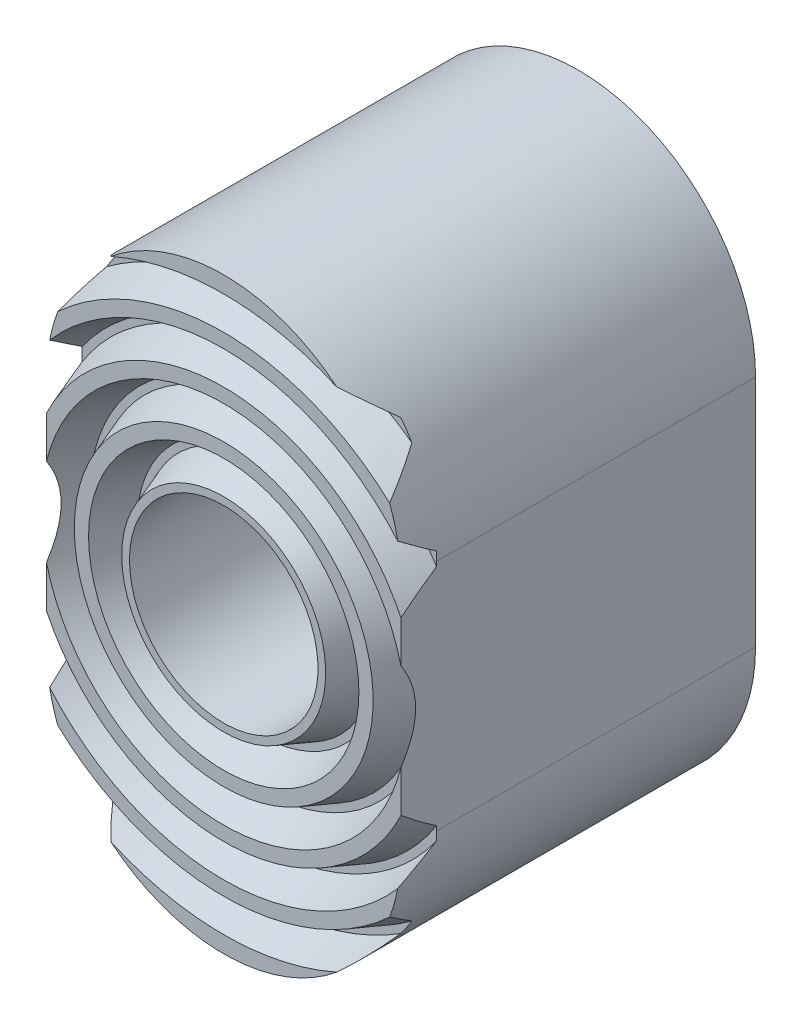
ISO-10303-21;
HEADER;
FILE_DESCRIPTION(('STEP AP214'),'2;1');
FILE_NAME('part.step','',(''),(''),'','','');
FILE_SCHEMA(('AUTOMOTIVE_DESIGN { 1 0 10303 214 1 1 1 1 }'));
ENDSEC;
DATA;
#1=APPLICATION_CONTEXT('core data for automotive mechanical design processes');
#2=APPLICATION_PROTOCOL_DEFINITION('international standard','automotive_design',2000,#1);
#3=PRODUCT_CONTEXT('',#1,'mechanical');
#4=PRODUCT('Part','Part','',(#3));
#5=PRODUCT_RELATED_PRODUCT_CATEGORY('part','',(#4));
#6=PRODUCT_DEFINITION_FORMATION('','',#4);
#7=PRODUCT_DEFINITION_CONTEXT('part definition',#1,'design');
#8=PRODUCT_DEFINITION('design','',#6,#7);
#9=PRODUCT_DEFINITION_SHAPE('','',#8);
#10=(LENGTH_UNIT() NAMED_UNIT(*) SI_UNIT(.MILLI.,.METRE.));
#11=(NAMED_UNIT(*) PLANE_ANGLE_UNIT() SI_UNIT($,.RADIAN.));
#12=(NAMED_UNIT(*) SI_UNIT($,.STERADIAN.) SOLID_ANGLE_UNIT());
#13=UNCERTAINTY_MEASURE_WITH_UNIT(LENGTH_MEASURE(1.E-05),#10,'distance_accuracy_value','');
#14=(GEOMETRIC_REPRESENTATION_CONTEXT(3) GLOBAL_UNCERTAINTY_ASSIGNED_CONTEXT((#13)) GLOBAL_UNIT_ASSIGNED_CONTEXT((#10,
#11,#12)) REPRESENTATION_CONTEXT('',''));
#15=CARTESIAN_POINT('',(0.,0.,0.));
#16=DIRECTION('',(0.,0.,1.));
#17=DIRECTION('',(1.,0.,0.));
#18=AXIS2_PLACEMENT_3D('',#15,#16,#17);
#19=CARTESIAN_POINT('',(0.,-2.5019,0.));
#20=DIRECTION('',(0.,0.,1.));
#21=DIRECTION('',(1.,0.,0.));
#22=AXIS2_PLACEMENT_3D('',#19,#20,#21);
#23=PLANE('',#22);
#24=CARTESIAN_POINT('',(0.,-2.5019,0.));
#25=DIRECTION('',(0.,0.,1.));
#26=DIRECTION('',(1.,0.,0.));
#27=AXIS2_PLACEMENT_3D('',#24,#25,#26);
#28=CIRCLE('',#27,3.7973);
#29=CARTESIAN_POINT('',(-3.7973,-2.5019,0.));
#30=VERTEX_POINT('',#29);
#31=CARTESIAN_POINT('',(3.7973,-2.5019,0.));
#32=VERTEX_POINT('',#31);
#33=EDGE_CURVE('E225',#30,#32,#28,.T.);
#34=ORIENTED_EDGE('',*,*,#33,.F.);
#35=DIRECTION('',(0.,-1.,0.));
#36=VECTOR('',#35,1.);
#37=CARTESIAN_POINT('',(-3.7973,-2.5019,0.));
#38=LINE('',#37,#36);
#39=CARTESIAN_POINT('',(-3.7973,2.5019,0.));
#40=VERTEX_POINT('',#39);
#41=EDGE_CURVE('E235',#40,#30,#38,.T.);
#42=ORIENTED_EDGE('',*,*,#41,.F.);
#43=CARTESIAN_POINT('',(0.,2.5019,0.));
#44=DIRECTION('',(0.,0.,1.));
#45=DIRECTION('',(1.,0.,0.));
#46=AXIS2_PLACEMENT_3D('',#43,#44,#45);
#47=CIRCLE('',#46,3.7973);
#48=CARTESIAN_POINT('',(3.7973,2.5019,0.));
#49=VERTEX_POINT('',#48);
#50=EDGE_CURVE('E232',#49,#40,#47,.T.);
#51=ORIENTED_EDGE('',*,*,#50,.F.);
#52=DIRECTION('',(0.,1.,0.));
#53=VECTOR('',#52,1.);
#54=CARTESIAN_POINT('',(3.7973,-2.5019,0.));
#55=LINE('',#54,#53);
#56=EDGE_CURVE('E228',#32,#49,#55,.T.);
#57=ORIENTED_EDGE('',*,*,#56,.F.);
#58=EDGE_LOOP('',(#34,#42,#51,#57));
#59=FACE_BOUND('',#58,.T.);
#60=CARTESIAN_POINT('',(0.,0.,0.));
#61=DIRECTION('',(0.,0.,-1.));
#62=DIRECTION('',(-1.,0.,0.));
#63=AXIS2_PLACEMENT_3D('',#60,#61,#62);
#64=CIRCLE('',#63,2.0193);
#65=CARTESIAN_POINT('',(-2.0193,0.,0.));
#66=VERTEX_POINT('',#65);
#67=EDGE_CURVE('E366',#66,#66,#64,.T.);
#68=ORIENTED_EDGE('',*,*,#67,.F.);
#69=EDGE_LOOP('',(#68));
#70=FACE_BOUND('',#69,.T.);
#71=ADVANCED_FACE('F41',(#59,#70),#23,.F.);
#72=CARTESIAN_POINT('',(0.,-2.5019,7.5946));
#73=DIRECTION('',(0.,0.,1.));
#74=DIRECTION('',(1.,0.,0.));
#75=AXIS2_PLACEMENT_3D('',#72,#73,#74);
#76=PLANE('',#75);
#77=CARTESIAN_POINT('',(0.,0.,7.5946));
#78=DIRECTION('',(0.,0.,-1.));
#79=DIRECTION('',(-1.,0.,0.));
#80=AXIS2_PLACEMENT_3D('',#77,#78,#79);
#81=CIRCLE('',#80,3.2004);
#82=CARTESIAN_POINT('',(-3.2004,0.,7.5946));
#83=VERTEX_POINT('',#82);
#84=EDGE_CURVE('E198',#83,#83,#81,.T.);
#85=ORIENTED_EDGE('',*,*,#84,.F.);
#86=EDGE_LOOP('',(#85));
#87=FACE_BOUND('',#86,.T.);
#88=CARTESIAN_POINT('',(0.,0.,7.5946));
#89=DIRECTION('',(0.,0.,-1.));
#90=DIRECTION('',(-1.,0.,0.));
#91=AXIS2_PLACEMENT_3D('',#88,#89,#90);
#92=CIRCLE('',#91,2.8956);
#93=CARTESIAN_POINT('',(-2.8956,0.,7.5946));
#94=VERTEX_POINT('',#93);
#95=EDGE_CURVE('E528',#94,#94,#92,.T.);
#96=ORIENTED_EDGE('',*,*,#95,.T.);
#97=EDGE_LOOP('',(#96));
#98=FACE_BOUND('',#97,.T.);
#99=ADVANCED_FACE('F348',(#87,#98),#76,.T.);
#100=CARTESIAN_POINT('',(0.,2.61825468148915,6.8326));
#101=DIRECTION('',(0.,0.,-1.));
#102=DIRECTION('',(-1.,0.,0.));
#103=AXIS2_PLACEMENT_3D('',#100,#101,#102);
#104=PLANE('',#103);
#105=CARTESIAN_POINT('',(0.,0.,6.8326));
#106=DIRECTION('',(0.,0.,-1.));
#107=DIRECTION('',(-1.,0.,0.));
#108=AXIS2_PLACEMENT_3D('',#105,#106,#107);
#109=CIRCLE('',#108,2.61825468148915);
#110=CARTESIAN_POINT('',(-2.61825468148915,0.,6.8326));
#111=VERTEX_POINT('',#110);
#112=EDGE_CURVE('E531',#111,#111,#109,.T.);
#113=ORIENTED_EDGE('',*,*,#112,.F.);
#114=EDGE_LOOP('',(#113));
#115=FACE_BOUND('',#114,.T.);
#116=CARTESIAN_POINT('',(0.,0.,6.8326));
#117=DIRECTION('',(0.,0.,-1.));
#118=DIRECTION('',(-1.,0.,0.));
#119=AXIS2_PLACEMENT_3D('',#116,#117,#118);
#120=CIRCLE('',#119,2.46174531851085);
#121=CARTESIAN_POINT('',(-2.46174531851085,0.,6.8326));
#122=VERTEX_POINT('',#121);
#123=EDGE_CURVE('E229',#122,#122,#120,.T.);
#124=ORIENTED_EDGE('',*,*,#123,.T.);
#125=EDGE_LOOP('',(#124));
#126=FACE_BOUND('',#125,.T.);
#127=ADVANCED_FACE('F344',(#115,#126),#104,.F.);
#128=CARTESIAN_POINT('',(0.,0.,7.5946));
#129=DIRECTION('',(0.,0.,-1.));
#130=DIRECTION('',(-1.,0.,0.));
#131=AXIS2_PLACEMENT_3D('',#128,#129,#130);
#132=CONICAL_SURFACE('',#131,2.1844,0.349065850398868);
#133=ORIENTED_EDGE('',*,*,#123,.F.);
#134=EDGE_LOOP('',(#133));
#135=FACE_BOUND('',#134,.T.);
#136=CARTESIAN_POINT('',(0.,0.,7.5946));
#137=DIRECTION('',(0.,0.,-1.));
#138=DIRECTION('',(-1.,0.,0.));
#139=AXIS2_PLACEMENT_3D('',#136,#137,#138);
#140=CIRCLE('',#139,2.1844);
#141=CARTESIAN_POINT('',(-2.1844,0.,7.5946));
#142=VERTEX_POINT('',#141);
#143=EDGE_CURVE('E525',#142,#142,#140,.T.);
#144=ORIENTED_EDGE('',*,*,#143,.T.);
#145=EDGE_LOOP('',(#144));
#146=FACE_BOUND('',#145,.T.);
#147=ADVANCED_FACE('F340',(#135,#146),#132,.T.);
#148=CARTESIAN_POINT('',(0.,0.,6.8326));
#149=DIRECTION('',(0.,0.,1.));
#150=DIRECTION('',(1.,0.,0.));
#151=AXIS2_PLACEMENT_3D('',#148,#149,#150);
#152=CONICAL_SURFACE('',#151,2.61825468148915,0.349065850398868);
#153=ORIENTED_EDGE('',*,*,#95,.F.);
#154=EDGE_LOOP('',(#153));
#155=FACE_BOUND('',#154,.T.);
#156=ORIENTED_EDGE('',*,*,#112,.T.);
#157=EDGE_LOOP('',(#156));
#158=FACE_BOUND('',#157,.T.);
#159=ADVANCED_FACE('F337',(#155,#158),#152,.F.);
#160=CARTESIAN_POINT('',(0.,0.,7.5946));
#161=DIRECTION('',(0.,0.,-1.));
#162=DIRECTION('',(-1.,0.,0.));
#163=AXIS2_PLACEMENT_3D('',#160,#161,#162);
#164=CIRCLE('',#163,2.0193);
#165=CARTESIAN_POINT('',(-2.0193,0.,7.5946));
#166=VERTEX_POINT('',#165);
#167=EDGE_CURVE('E368',#166,#166,#164,.T.);
#168=ORIENTED_EDGE('',*,*,#167,.T.);
#169=EDGE_LOOP('',(#168));
#170=FACE_BOUND('',#169,.T.);
#171=ORIENTED_EDGE('',*,*,#143,.F.);
#172=EDGE_LOOP('',(#171));
#173=FACE_BOUND('',#172,.T.);
#174=ADVANCED_FACE('F324',(#170,#173),#76,.T.);
#175=CARTESIAN_POINT('',(0.,0.,6.8326));
#176=DIRECTION('',(0.,0.,1.));
#177=DIRECTION('',(1.,0.,0.));
#178=AXIS2_PLACEMENT_3D('',#175,#176,#177);
#179=CONICAL_SURFACE('',#178,3.63425468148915,0.349065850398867);
#180=CARTESIAN_POINT('',(0.,0.,6.8326));
#181=DIRECTION('',(0.,0.,-1.));
#182=DIRECTION('',(-1.,0.,0.));
#183=AXIS2_PLACEMENT_3D('',#180,#181,#182);
#184=CIRCLE('',#183,3.63425468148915);
#185=CARTESIAN_POINT('',(-3.63425468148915,0.,6.8326));
#186=VERTEX_POINT('',#185);
#187=EDGE_CURVE('E199',#186,#186,#184,.T.);
#188=ORIENTED_EDGE('',*,*,#187,.T.);
#189=EDGE_LOOP('',(#188));
#190=FACE_BOUND('',#189,.T.);
#191=CARTESIAN_POINT('',(0.,0.,7.5946));
#192=DIRECTION('',(0.,0.,-1.));
#193=DIRECTION('',(-1.,0.,0.));
#194=AXIS2_PLACEMENT_3D('',#191,#192,#193);
#195=CIRCLE('',#194,3.9116);
#196=CARTESIAN_POINT('',(-3.7973,0.938683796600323,7.5946));
#197=VERTEX_POINT('',#196);
#198=CARTESIAN_POINT('',(3.7973,0.938683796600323,7.5946));
#199=VERTEX_POINT('',#198);
#200=EDGE_CURVE('E190',#197,#199,#195,.T.);
#201=ORIENTED_EDGE('',*,*,#200,.F.);
#202=CARTESIAN_POINT('',(-3.7973,-3.11385889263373,10.3397809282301));
#203=CARTESIAN_POINT('',(-3.7973,-3.03024523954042,10.1942291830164));
#204=CARTESIAN_POINT('',(-3.7973,-2.9451980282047,10.0494659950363));
#205=CARTESIAN_POINT('',(-3.7973,-2.77126215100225,9.76200828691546));
#206=CARTESIAN_POINT('',(-3.7973,-2.68236852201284,9.61931677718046));
#207=CARTESIAN_POINT('',(-3.7973,-2.49829517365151,9.33427068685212));
#208=CARTESIAN_POINT('',(-3.7973,-2.40302954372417,9.19197125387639));
#209=CARTESIAN_POINT('',(-3.7973,-2.20643004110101,8.91169262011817));
#210=CARTESIAN_POINT('',(-3.7973,-2.10509965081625,8.77371100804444));
#211=CARTESIAN_POINT('',(-3.7973,-1.9364942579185,8.557877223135));
#212=CARTESIAN_POINT('',(-3.7973,-1.87178576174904,8.47802446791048));
#213=CARTESIAN_POINT('',(-3.7973,-1.73890696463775,8.32126370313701));
#214=CARTESIAN_POINT('',(-3.7973,-1.67073745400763,8.24435502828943));
#215=CARTESIAN_POINT('',(-3.7973,-1.53044980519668,8.09465262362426));
#216=CARTESIAN_POINT('',(-3.7973,-1.45834499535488,8.02184651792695));
#217=CARTESIAN_POINT('',(-3.7973,-1.30918766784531,7.881538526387));
#218=CARTESIAN_POINT('',(-3.7973,-1.23213843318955,7.81403318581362));
#219=CARTESIAN_POINT('',(-3.7973,-1.05991040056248,7.67663300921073));
#220=CARTESIAN_POINT('',(-3.7973,-0.963755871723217,7.60793398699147));
#221=CARTESIAN_POINT('',(-3.7973,-0.762330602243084,7.4853272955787));
#222=CARTESIAN_POINT('',(-3.7973,-0.657078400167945,7.43139043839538));
#223=CARTESIAN_POINT('',(-3.7973,-0.459985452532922,7.35415123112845));
#224=CARTESIAN_POINT('',(-3.7973,-0.369755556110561,7.32685394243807));
#225=CARTESIAN_POINT('',(-3.7973,-0.185804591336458,7.29002737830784));
#226=CARTESIAN_POINT('',(-3.7973,-0.0920926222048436,7.280454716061));
#227=CARTESIAN_POINT('',(-3.7973,0.0956276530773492,7.28067418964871));
#228=CARTESIAN_POINT('',(-3.7973,0.189635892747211,7.29053174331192));
#229=CARTESIAN_POINT('',(-3.7973,0.374034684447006,7.32798711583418));
#230=CARTESIAN_POINT('',(-3.7973,0.464418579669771,7.35561612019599));
#231=CARTESIAN_POINT('',(-3.7973,0.665261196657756,7.43496776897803));
#232=CARTESIAN_POINT('',(-3.7973,0.773825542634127,7.49138198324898));
#233=CARTESIAN_POINT('',(-3.7973,0.929632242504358,7.58774688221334));
#234=CARTESIAN_POINT('',(-3.7973,0.980624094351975,7.6220207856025));
#235=CARTESIAN_POINT('',(-3.7973,1.08031211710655,7.69375495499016));
#236=CARTESIAN_POINT('',(-3.7973,1.12900895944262,7.7312142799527));
#237=CARTESIAN_POINT('',(-3.7973,1.24314187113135,7.82402195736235));
#238=CARTESIAN_POINT('',(-3.7973,1.30758228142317,7.88058664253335));
#239=CARTESIAN_POINT('',(-3.7973,1.43294780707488,7.99750686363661));
#240=CARTESIAN_POINT('',(-3.7973,1.49387110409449,8.0578643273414));
#241=CARTESIAN_POINT('',(-3.7973,1.67249918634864,8.24363644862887));
#242=CARTESIAN_POINT('',(-3.7973,1.78566253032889,8.37340867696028));
#243=CARTESIAN_POINT('',(-3.7973,1.99717682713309,8.63286782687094));
#244=CARTESIAN_POINT('',(-3.7973,2.09599759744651,8.76218130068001));
#245=CARTESIAN_POINT('',(-3.7973,2.23925312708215,8.95894514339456));
#246=CARTESIAN_POINT('',(-3.7973,2.28599753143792,9.02472857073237));
#247=CARTESIAN_POINT('',(-3.7973,2.37813511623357,9.15721014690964));
#248=CARTESIAN_POINT('',(-3.7973,2.42352865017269,9.22390804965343));
#249=CARTESIAN_POINT('',(-3.7973,2.46833712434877,9.29099400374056));
#250=B_SPLINE_CURVE_WITH_KNOTS('',3,(#202,#203,#204,#205,#206,#207,#208,#209,#210,#211,#212,
#213,#214,#215,#216,#217,#218,#219,#220,#221,#222,#223,#224,#225,#226,#227,#228,#229,#230,#231,
#232,#233,#234,#235,#236,#237,#238,#239,#240,#241,#242,#243,#244,#245,#246,#247,#248,#249),
.UNSPECIFIED.,.F.,.F.,(4,2,2,2,2,2,2,2,2,2,2,2,2,2,2,2,2,2,2,2,2,2,2,4),(0.,0.503614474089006,
1.00789937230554,1.52152056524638,2.03484961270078,2.34311160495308,2.65130352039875,
2.9585095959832,3.26551376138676,3.61917195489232,3.97212575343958,4.2534776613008,
4.53413995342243,4.81574879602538,5.0978531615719,5.46275913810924,5.64700575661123,
5.83119813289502,6.08822887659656,6.34539133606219,6.86128677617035,7.3493372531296,
7.59142272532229,7.83344428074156),.UNSPECIFIED.);
#251=CARTESIAN_POINT('',(-3.7973,-0.938683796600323,7.5946));
#252=VERTEX_POINT('',#251);
#253=EDGE_CURVE('E57',#252,#197,#250,.T.);
#254=ORIENTED_EDGE('',*,*,#253,.F.);
#255=CARTESIAN_POINT('',(0.,0.,7.5946));
#256=DIRECTION('',(0.,0.,1.));
#257=DIRECTION('',(1.,0.,0.));
#258=AXIS2_PLACEMENT_3D('',#255,#256,#257);
#259=CIRCLE('',#258,3.9116);
#260=CARTESIAN_POINT('',(3.7973,-0.938683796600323,7.5946));
#261=VERTEX_POINT('',#260);
#262=EDGE_CURVE('E245',#252,#261,#259,.T.);
#263=ORIENTED_EDGE('',*,*,#262,.T.);
#264=CARTESIAN_POINT('',(3.7973,-3.11385889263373,10.3397809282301));
#265=CARTESIAN_POINT('',(3.7973,-3.03024523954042,10.1942291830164));
#266=CARTESIAN_POINT('',(3.7973,-2.9451980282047,10.0494659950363));
#267=CARTESIAN_POINT('',(3.7973,-2.77126215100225,9.76200828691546));
#268=CARTESIAN_POINT('',(3.7973,-2.68236852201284,9.61931677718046));
#269=CARTESIAN_POINT('',(3.7973,-2.49829517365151,9.33427068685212));
#270=CARTESIAN_POINT('',(3.7973,-2.40302954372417,9.19197125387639));
#271=CARTESIAN_POINT('',(3.7973,-2.20643004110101,8.91169262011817));
#272=CARTESIAN_POINT('',(3.7973,-2.10509965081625,8.77371100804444));
#273=CARTESIAN_POINT('',(3.7973,-1.9364942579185,8.557877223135));
#274=CARTESIAN_POINT('',(3.7973,-1.87178576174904,8.47802446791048));
#275=CARTESIAN_POINT('',(3.7973,-1.73890696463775,8.32126370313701));
#276=CARTESIAN_POINT('',(3.7973,-1.67073745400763,8.24435502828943));
#277=CARTESIAN_POINT('',(3.7973,-1.53044980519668,8.09465262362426));
#278=CARTESIAN_POINT('',(3.7973,-1.45834499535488,8.02184651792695));
#279=CARTESIAN_POINT('',(3.7973,-1.30918766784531,7.881538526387));
#280=CARTESIAN_POINT('',(3.7973,-1.23213843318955,7.81403318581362));
#281=CARTESIAN_POINT('',(3.7973,-1.05991040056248,7.67663300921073));
#282=CARTESIAN_POINT('',(3.7973,-0.963755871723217,7.60793398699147));
#283=CARTESIAN_POINT('',(3.7973,-0.762330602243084,7.4853272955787));
#284=CARTESIAN_POINT('',(3.7973,-0.657078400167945,7.43139043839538));
#285=CARTESIAN_POINT('',(3.7973,-0.459985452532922,7.35415123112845));
#286=CARTESIAN_POINT('',(3.7973,-0.369755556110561,7.32685394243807));
#287=CARTESIAN_POINT('',(3.7973,-0.185804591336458,7.29002737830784));
#288=CARTESIAN_POINT('',(3.7973,-0.0920926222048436,7.280454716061));
#289=CARTESIAN_POINT('',(3.7973,0.0956276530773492,7.28067418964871));
#290=CARTESIAN_POINT('',(3.7973,0.189635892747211,7.29053174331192));
#291=CARTESIAN_POINT('',(3.7973,0.374034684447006,7.32798711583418));
#292=CARTESIAN_POINT('',(3.7973,0.464418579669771,7.35561612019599));
#293=CARTESIAN_POINT('',(3.7973,0.665261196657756,7.43496776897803));
#294=CARTESIAN_POINT('',(3.7973,0.773825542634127,7.49138198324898));
#295=CARTESIAN_POINT('',(3.7973,0.929632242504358,7.58774688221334));
#296=CARTESIAN_POINT('',(3.7973,0.980624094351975,7.6220207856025));
#297=CARTESIAN_POINT('',(3.7973,1.08031211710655,7.69375495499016));
#298=CARTESIAN_POINT('',(3.7973,1.12900895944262,7.7312142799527));
#299=CARTESIAN_POINT('',(3.7973,1.24314187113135,7.82402195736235));
#300=CARTESIAN_POINT('',(3.7973,1.30758228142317,7.88058664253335));
#301=CARTESIAN_POINT('',(3.7973,1.43294780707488,7.99750686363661));
#302=CARTESIAN_POINT('',(3.7973,1.49387110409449,8.0578643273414));
#303=CARTESIAN_POINT('',(3.7973,1.67249918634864,8.24363644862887));
#304=CARTESIAN_POINT('',(3.7973,1.78566253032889,8.37340867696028));
#305=CARTESIAN_POINT('',(3.7973,1.99717682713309,8.63286782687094));
#306=CARTESIAN_POINT('',(3.7973,2.09599759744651,8.76218130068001));
#307=CARTESIAN_POINT('',(3.7973,2.23925312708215,8.95894514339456));
#308=CARTESIAN_POINT('',(3.7973,2.28599753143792,9.02472857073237));
#309=CARTESIAN_POINT('',(3.7973,2.37813511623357,9.15721014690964));
#310=CARTESIAN_POINT('',(3.7973,2.42352865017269,9.22390804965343));
#311=CARTESIAN_POINT('',(3.7973,2.46833712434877,9.29099400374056));
#312=B_SPLINE_CURVE_WITH_KNOTS('',3,(#264,#265,#266,#267,#268,#269,#270,#271,#272,#273,#274,
#275,#276,#277,#278,#279,#280,#281,#282,#283,#284,#285,#286,#287,#288,#289,#290,#291,#292,#293,
#294,#295,#296,#297,#298,#299,#300,#301,#302,#303,#304,#305,#306,#307,#308,#309,#310,#311),
.UNSPECIFIED.,.F.,.F.,(4,2,2,2,2,2,2,2,2,2,2,2,2,2,2,2,2,2,2,2,2,2,2,4),(0.,0.503614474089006,
1.00789937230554,1.52152056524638,2.03484961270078,2.34311160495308,2.65130352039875,
2.9585095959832,3.26551376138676,3.61917195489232,3.97212575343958,4.2534776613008,
4.53413995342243,4.81574879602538,5.0978531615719,5.46275913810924,5.64700575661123,
5.83119813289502,6.08822887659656,6.34539133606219,6.86128677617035,7.3493372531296,
7.59142272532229,7.83344428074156),.UNSPECIFIED.);
#313=EDGE_CURVE('E193',#199,#261,#312,.F.);
#314=ORIENTED_EDGE('',*,*,#313,.F.);
#315=EDGE_LOOP('',(#201,#254,#263,#314));
#316=FACE_BOUND('',#315,.T.);
#317=ADVANCED_FACE('F191',(#190,#316),#179,.F.);
#318=CARTESIAN_POINT('',(0.,3.63425468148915,6.8326));
#319=DIRECTION('',(0.,0.,-1.));
#320=DIRECTION('',(-1.,0.,0.));
#321=AXIS2_PLACEMENT_3D('',#318,#319,#320);
#322=PLANE('',#321);
#323=ORIENTED_EDGE('',*,*,#187,.F.);
#324=EDGE_LOOP('',(#323));
#325=FACE_BOUND('',#324,.T.);
#326=CARTESIAN_POINT('',(0.,0.,6.8326));
#327=DIRECTION('',(0.,0.,-1.));
#328=DIRECTION('',(-1.,0.,0.));
#329=AXIS2_PLACEMENT_3D('',#326,#327,#328);
#330=CIRCLE('',#329,3.47774531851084);
#331=CARTESIAN_POINT('',(-3.47774531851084,0.,6.8326));
#332=VERTEX_POINT('',#331);
#333=EDGE_CURVE('E211',#332,#332,#330,.T.);
#334=ORIENTED_EDGE('',*,*,#333,.T.);
#335=EDGE_LOOP('',(#334));
#336=FACE_BOUND('',#335,.T.);
#337=ADVANCED_FACE('F323',(#325,#336),#322,.F.);
#338=CARTESIAN_POINT('',(0.,0.,7.5946));
#339=DIRECTION('',(0.,0.,-1.));
#340=DIRECTION('',(-1.,0.,0.));
#341=AXIS2_PLACEMENT_3D('',#338,#339,#340);
#342=CONICAL_SURFACE('',#341,3.2004,0.349065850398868);
#343=ORIENTED_EDGE('',*,*,#333,.F.);
#344=EDGE_LOOP('',(#343));
#345=FACE_BOUND('',#344,.T.);
#346=ORIENTED_EDGE('',*,*,#84,.T.);
#347=EDGE_LOOP('',(#346));
#348=FACE_BOUND('',#347,.T.);
#349=ADVANCED_FACE('F328',(#345,#348),#342,.T.);
#350=CARTESIAN_POINT('',(0.,0.,7.5946));
#351=DIRECTION('',(0.,0.,1.));
#352=DIRECTION('',(1.,0.,0.));
#353=AXIS2_PLACEMENT_3D('',#350,#351,#352);
#354=CIRCLE('',#353,5.9436);
#355=CARTESIAN_POINT('',(-2.41881694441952,-5.42915329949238,7.5946));
#356=VERTEX_POINT('',#355);
#357=CARTESIAN_POINT('',(2.41881694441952,-5.42915329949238,7.5946));
#358=VERTEX_POINT('',#357);
#359=EDGE_CURVE('E247',#356,#358,#354,.T.);
#360=ORIENTED_EDGE('',*,*,#359,.F.);
#361=CARTESIAN_POINT('',(0.,-2.5019,7.5946));
#362=DIRECTION('',(0.,0.,1.));
#363=DIRECTION('',(1.,0.,0.));
#364=AXIS2_PLACEMENT_3D('',#361,#362,#363);
#365=CIRCLE('',#364,3.7973);
#366=EDGE_CURVE('E519',#356,#358,#365,.T.);
#367=ORIENTED_EDGE('',*,*,#366,.T.);
#368=EDGE_LOOP('',(#360,#367));
#369=FACE_BOUND('',#368,.T.);
#370=ADVANCED_FACE('F332',(#369),#76,.T.);
#371=CARTESIAN_POINT('',(0.,0.,7.5946));
#372=DIRECTION('',(0.,0.,1.));
#373=DIRECTION('',(1.,0.,0.));
#374=AXIS2_PLACEMENT_3D('',#371,#372,#373);
#375=CIRCLE('',#374,4.9276);
#376=CARTESIAN_POINT('',(-3.7284349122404,-3.22180304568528,7.5946));
#377=VERTEX_POINT('',#376);
#378=CARTESIAN_POINT('',(3.7284349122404,-3.22180304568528,7.5946));
#379=VERTEX_POINT('',#378);
#380=EDGE_CURVE('E251',#377,#379,#375,.T.);
#381=ORIENTED_EDGE('',*,*,#380,.F.);
#382=CARTESIAN_POINT('',(-3.55346852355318,-3.84068629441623,7.5946));
#383=VERTEX_POINT('',#382);
#384=EDGE_CURVE('E517',#377,#383,#365,.T.);
#385=ORIENTED_EDGE('',*,*,#384,.T.);
#386=CARTESIAN_POINT('',(0.,0.,7.5946));
#387=DIRECTION('',(0.,0.,1.));
#388=DIRECTION('',(1.,0.,0.));
#389=AXIS2_PLACEMENT_3D('',#386,#387,#388);
#390=CIRCLE('',#389,5.23239999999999);
#391=CARTESIAN_POINT('',(3.55346852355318,-3.84068629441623,7.5946));
#392=VERTEX_POINT('',#391);
#393=EDGE_CURVE('E249',#392,#383,#390,.F.);
#394=ORIENTED_EDGE('',*,*,#393,.F.);
#395=EDGE_CURVE('E238',#392,#379,#365,.T.);
#396=ORIENTED_EDGE('',*,*,#395,.T.);
#397=EDGE_LOOP('',(#381,#385,#394,#396));
#398=FACE_BOUND('',#397,.T.);
#399=ADVANCED_FACE('F351',(#398),#76,.T.);
#400=CARTESIAN_POINT('',(0.,0.,7.5946));
#401=DIRECTION('',(0.,0.,-1.));
#402=DIRECTION('',(-1.,0.,0.));
#403=AXIS2_PLACEMENT_3D('',#400,#401,#402);
#404=CIRCLE('',#403,5.9436);
#405=CARTESIAN_POINT('',(-2.41881694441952,5.42915329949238,7.5946));
#406=VERTEX_POINT('',#405);
#407=CARTESIAN_POINT('',(2.41881694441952,5.42915329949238,7.5946));
#408=VERTEX_POINT('',#407);
#409=EDGE_CURVE('E374',#406,#408,#404,.T.);
#410=ORIENTED_EDGE('',*,*,#409,.T.);
#411=CARTESIAN_POINT('',(0.,2.5019,7.5946));
#412=DIRECTION('',(0.,0.,1.));
#413=DIRECTION('',(1.,0.,0.));
#414=AXIS2_PLACEMENT_3D('',#411,#412,#413);
#415=CIRCLE('',#414,3.7973);
#416=EDGE_CURVE('E382',#408,#406,#415,.T.);
#417=ORIENTED_EDGE('',*,*,#416,.T.);
#418=EDGE_LOOP('',(#410,#417));
#419=FACE_BOUND('',#418,.T.);
#420=ADVANCED_FACE('F359',(#419),#76,.T.);
#421=CARTESIAN_POINT('',(0.,0.,7.5946));
#422=DIRECTION('',(0.,0.,-1.));
#423=DIRECTION('',(-1.,0.,0.));
#424=AXIS2_PLACEMENT_3D('',#421,#422,#423);
#425=CIRCLE('',#424,4.9276);
#426=CARTESIAN_POINT('',(-3.7284349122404,3.22180304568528,7.5946));
#427=VERTEX_POINT('',#426);
#428=CARTESIAN_POINT('',(3.7284349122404,3.22180304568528,7.5946));
#429=VERTEX_POINT('',#428);
#430=EDGE_CURVE('E293',#427,#429,#425,.T.);
#431=ORIENTED_EDGE('',*,*,#430,.T.);
#432=CARTESIAN_POINT('',(3.55346852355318,3.84068629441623,7.5946));
#433=VERTEX_POINT('',#432);
#434=EDGE_CURVE('E220',#429,#433,#415,.T.);
#435=ORIENTED_EDGE('',*,*,#434,.T.);
#436=CARTESIAN_POINT('',(0.,0.,7.5946));
#437=DIRECTION('',(0.,0.,-1.));
#438=DIRECTION('',(-1.,0.,0.));
#439=AXIS2_PLACEMENT_3D('',#436,#437,#438);
#440=CIRCLE('',#439,5.23239999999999);
#441=CARTESIAN_POINT('',(-3.55346852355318,3.84068629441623,7.5946));
#442=VERTEX_POINT('',#441);
#443=EDGE_CURVE('E371',#442,#433,#440,.T.);
#444=ORIENTED_EDGE('',*,*,#443,.F.);
#445=EDGE_CURVE('E223',#442,#427,#415,.T.);
#446=ORIENTED_EDGE('',*,*,#445,.T.);
#447=EDGE_LOOP('',(#431,#435,#444,#446));
#448=FACE_BOUND('',#447,.T.);
#449=ADVANCED_FACE('F727',(#448),#76,.T.);
#450=CARTESIAN_POINT('',(0.,0.,7.5946));
#451=DIRECTION('',(0.,0.,-1.));
#452=DIRECTION('',(-1.,0.,0.));
#453=AXIS2_PLACEMENT_3D('',#450,#451,#452);
#454=CIRCLE('',#453,4.21639999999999);
#455=CARTESIAN_POINT('',(-3.7973,1.83263244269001,7.5946));
#456=VERTEX_POINT('',#455);
#457=CARTESIAN_POINT('',(3.7973,1.83263244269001,7.5946));
#458=VERTEX_POINT('',#457);
#459=EDGE_CURVE('E215',#456,#458,#454,.T.);
#460=ORIENTED_EDGE('',*,*,#459,.F.);
#461=DIRECTION('',(0.,-1.,0.));
#462=VECTOR('',#461,1.);
#463=CARTESIAN_POINT('',(-3.7973,-2.5019,7.5946));
#464=LINE('',#463,#462);
#465=EDGE_CURVE('E207',#456,#197,#464,.T.);
#466=ORIENTED_EDGE('',*,*,#465,.T.);
#467=ORIENTED_EDGE('',*,*,#200,.T.);
#468=DIRECTION('',(0.,1.,0.));
#469=VECTOR('',#468,1.);
#470=CARTESIAN_POINT('',(3.7973,-2.5019,7.5946));
#471=LINE('',#470,#469);
#472=EDGE_CURVE('E514',#199,#458,#471,.T.);
#473=ORIENTED_EDGE('',*,*,#472,.T.);
#474=EDGE_LOOP('',(#460,#466,#467,#473));
#475=FACE_BOUND('',#474,.T.);
#476=ADVANCED_FACE('F214',(#475),#76,.T.);
#477=CARTESIAN_POINT('',(0.,0.,7.5946));
#478=DIRECTION('',(0.,0.,1.));
#479=DIRECTION('',(1.,0.,0.));
#480=AXIS2_PLACEMENT_3D('',#477,#478,#479);
#481=CIRCLE('',#480,4.21639999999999);
#482=CARTESIAN_POINT('',(3.7973,-1.83263244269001,7.5946));
#483=VERTEX_POINT('',#482);
#484=CARTESIAN_POINT('',(-3.7973,-1.83263244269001,7.5946));
#485=VERTEX_POINT('',#484);
#486=EDGE_CURVE('E253',#483,#485,#481,.F.);
#487=ORIENTED_EDGE('',*,*,#486,.F.);
#488=EDGE_CURVE('E509',#483,#261,#471,.T.);
#489=ORIENTED_EDGE('',*,*,#488,.T.);
#490=ORIENTED_EDGE('',*,*,#262,.F.);
#491=EDGE_CURVE('E210',#252,#485,#464,.T.);
#492=ORIENTED_EDGE('',*,*,#491,.T.);
#493=EDGE_LOOP('',(#487,#489,#490,#492));
#494=FACE_BOUND('',#493,.T.);
#495=ADVANCED_FACE('F508',(#494),#76,.T.);
#496=CARTESIAN_POINT('',(-3.7973,-2.5019,7.5946));
#497=DIRECTION('',(1.,0.,0.));
#498=DIRECTION('',(0.,0.,-1.));
#499=AXIS2_PLACEMENT_3D('',#496,#497,#498);
#500=PLANE('',#499);
#501=DIRECTION('',(0.,0.,-1.));
#502=VECTOR('',#501,1.);
#503=CARTESIAN_POINT('',(-3.7973,-2.5019,7.5946));
#504=LINE('',#503,#502);
#505=CARTESIAN_POINT('',(-3.7973,-2.5019,6.8326));
#506=VERTEX_POINT('',#505);
#507=EDGE_CURVE('E216',#506,#30,#504,.T.);
#508=ORIENTED_EDGE('',*,*,#507,.F.);
#509=DIRECTION('',(0.,1.,0.));
#510=VECTOR('',#509,1.);
#511=CARTESIAN_POINT('',(-3.7973,-2.5019,6.8326));
#512=LINE('',#511,#510);
#513=CARTESIAN_POINT('',(-3.7973,-2.40296893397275,6.8326));
#514=VERTEX_POINT('',#513);
#515=EDGE_CURVE('E256',#506,#514,#512,.T.);
#516=ORIENTED_EDGE('',*,*,#515,.T.);
#517=CARTESIAN_POINT('',(-3.7973,-4.11473788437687,3.7955073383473));
#518=CARTESIAN_POINT('',(-3.7973,-4.05282261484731,3.92051033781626));
#519=CARTESIAN_POINT('',(-3.7973,-3.99039846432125,4.04526199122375));
#520=CARTESIAN_POINT('',(-3.7973,-3.86437821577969,4.29418004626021));
#521=CARTESIAN_POINT('',(-3.7973,-3.80078205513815,4.41834641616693));
#522=CARTESIAN_POINT('',(-3.7973,-3.60781674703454,4.79020434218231));
#523=CARTESIAN_POINT('',(-3.7973,-3.47646018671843,5.0368698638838));
#524=CARTESIAN_POINT('',(-3.7973,-3.20295391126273,5.53333714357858));
#525=CARTESIAN_POINT('',(-3.7973,-3.06060385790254,5.78302980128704));
#526=CARTESIAN_POINT('',(-3.7973,-2.839419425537,6.15288871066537));
#527=CARTESIAN_POINT('',(-3.7973,-2.76443901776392,6.27535796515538));
#528=CARTESIAN_POINT('',(-3.7973,-2.61137374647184,6.51833567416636));
#529=CARTESIAN_POINT('',(-3.7973,-2.53328913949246,6.63884428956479));
#530=CARTESIAN_POINT('',(-3.7973,-2.37383179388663,6.87658929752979));
#531=CARTESIAN_POINT('',(-3.7973,-2.29248261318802,6.9938414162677));
#532=CARTESIAN_POINT('',(-3.7973,-2.12510869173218,7.22506431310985));
#533=CARTESIAN_POINT('',(-3.7973,-2.03908191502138,7.33903362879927));
#534=CARTESIAN_POINT('',(-3.7973,-1.86176906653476,7.56159137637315));
#535=CARTESIAN_POINT('',(-3.7973,-1.77052230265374,7.67021086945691));
#536=CARTESIAN_POINT('',(-3.7973,-1.5806929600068,7.88077700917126));
#537=CARTESIAN_POINT('',(-3.7973,-1.48211758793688,7.98273003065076));
#538=CARTESIAN_POINT('',(-3.7973,-1.29780805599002,8.15554287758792));
#539=CARTESIAN_POINT('',(-3.7973,-1.2139231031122,8.22835172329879));
#540=CARTESIAN_POINT('',(-3.7973,-1.03885775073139,8.36514645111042));
#541=CARTESIAN_POINT('',(-3.7973,-0.947664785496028,8.42911659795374));
#542=CARTESIAN_POINT('',(-3.7973,-0.755580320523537,8.54470555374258));
#543=CARTESIAN_POINT('',(-3.7973,-0.654560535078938,8.59611782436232));
#544=CARTESIAN_POINT('',(-3.7973,-0.444604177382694,8.678613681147));
#545=CARTESIAN_POINT('',(-3.7973,-0.335705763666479,8.70978880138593));
#546=CARTESIAN_POINT('',(-3.7973,-0.145536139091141,8.74067568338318));
#547=CARTESIAN_POINT('',(-3.7973,-0.0653156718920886,8.74685340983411));
#548=CARTESIAN_POINT('',(-3.7973,0.0950049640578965,8.74512272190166));
#549=CARTESIAN_POINT('',(-3.7973,0.175105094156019,8.73721047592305));
#550=CARTESIAN_POINT('',(-3.7973,0.332425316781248,8.70838369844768));
#551=CARTESIAN_POINT('',(-3.7973,0.40965805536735,8.68753594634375));
#552=CARTESIAN_POINT('',(-3.7973,0.560315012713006,8.63510409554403));
#553=CARTESIAN_POINT('',(-3.7973,0.633737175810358,8.60351426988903));
#554=CARTESIAN_POINT('',(-3.7973,0.834882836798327,8.50266161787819));
#555=CARTESIAN_POINT('',(-3.7973,0.957743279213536,8.42375243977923));
#556=CARTESIAN_POINT('',(-3.7973,1.13252624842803,8.29303399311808));
#557=CARTESIAN_POINT('',(-3.7973,1.1893391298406,8.2472655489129));
#558=CARTESIAN_POINT('',(-3.7973,1.30014785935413,8.15243281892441));
#559=CARTESIAN_POINT('',(-3.7973,1.35414470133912,8.10336971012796));
#560=CARTESIAN_POINT('',(-3.7973,1.49008494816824,7.97361972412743));
#561=CARTESIAN_POINT('',(-3.7973,1.5701837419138,7.89101512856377));
#562=CARTESIAN_POINT('',(-3.7973,1.7254137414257,7.72123292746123));
#563=CARTESIAN_POINT('',(-3.7973,1.80054207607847,7.63405273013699));
#564=CARTESIAN_POINT('',(-3.7973,1.9468602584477,7.45617320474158));
#565=CARTESIAN_POINT('',(-3.7973,2.01804186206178,7.36546713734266));
#566=CARTESIAN_POINT('',(-3.7973,2.15703018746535,7.18149624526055));
#567=CARTESIAN_POINT('',(-3.7973,2.22483631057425,7.08823097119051));
#568=CARTESIAN_POINT('',(-3.7973,2.42486945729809,6.80433565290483));
#569=CARTESIAN_POINT('',(-3.7973,2.55283402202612,6.61070607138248));
#570=CARTESIAN_POINT('',(-3.7973,2.80049621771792,6.21862573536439));
#571=CARTESIAN_POINT('',(-3.7973,2.92020326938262,6.02018083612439));
#572=CARTESIAN_POINT('',(-3.7973,3.1339094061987,5.65344980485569));
#573=CARTESIAN_POINT('',(-3.7973,3.22884526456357,5.48570684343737));
#574=CARTESIAN_POINT('',(-3.7973,3.41535490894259,5.14829805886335));
#575=CARTESIAN_POINT('',(-3.7973,3.5069276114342,4.97863163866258));
#576=CARTESIAN_POINT('',(-3.7973,3.68580582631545,4.64065065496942));
#577=CARTESIAN_POINT('',(-3.7973,3.77315685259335,4.47236010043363));
#578=CARTESIAN_POINT('',(-3.7973,3.94555710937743,4.13469783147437));
#579=CARTESIAN_POINT('',(-3.7973,4.03060735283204,3.9653266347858));
#580=CARTESIAN_POINT('',(-3.7973,4.11473788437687,3.7955073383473));
#581=B_SPLINE_CURVE_WITH_KNOTS('',3,(#517,#518,#519,#520,#521,#522,#523,#524,#525,#526,#527,
#528,#529,#530,#531,#532,#533,#534,#535,#536,#537,#538,#539,#540,#541,#542,#543,#544,#545,#546,
#547,#548,#549,#550,#551,#552,#553,#554,#555,#556,#557,#558,#559,#560,#561,#562,#563,#564,#565,
#566,#567,#568,#569,#570,#571,#572,#573,#574,#575,#576,#577,#578,#579,#580),.UNSPECIFIED.,.F.,
.F.,(4,2,2,2,2,2,2,2,2,2,2,2,2,2,2,2,2,2,2,2,2,2,2,2,2,2,2,2,2,2,2,4),(0.,0.418488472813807,
0.836999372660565,1.67530773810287,2.5373637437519,2.96812622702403,3.39885318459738,
3.82689245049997,4.25511953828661,4.68046356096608,5.10539471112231,5.43820194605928,
5.77159423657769,6.11014768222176,6.44715895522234,6.68735244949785,6.92761127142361,
7.16663996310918,7.40579628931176,7.84113706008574,8.05995919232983,8.27870356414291,
8.62361672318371,8.96872740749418,9.31453373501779,9.66040117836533,10.3563490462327,
11.0514893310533,11.6296762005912,12.2080477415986,12.7768594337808,13.3454164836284),.UNSPECIFIED.);
#582=EDGE_CURVE('E473',#514,#485,#581,.T.);
#583=ORIENTED_EDGE('',*,*,#582,.T.);
#584=ORIENTED_EDGE('',*,*,#491,.F.);
#585=ORIENTED_EDGE('',*,*,#253,.T.);
#586=ORIENTED_EDGE('',*,*,#465,.F.);
#587=CARTESIAN_POINT('',(-3.7973,2.40296893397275,6.8326));
#588=VERTEX_POINT('',#587);
#589=EDGE_CURVE('E468',#456,#588,#581,.T.);
#590=ORIENTED_EDGE('',*,*,#589,.T.);
#591=CARTESIAN_POINT('',(-3.7973,2.5019,6.8326));
#592=VERTEX_POINT('',#591);
#593=EDGE_CURVE('E254',#588,#592,#512,.T.);
#594=ORIENTED_EDGE('',*,*,#593,.T.);
#595=DIRECTION('',(0.,0.,-1.));
#596=VECTOR('',#595,1.);
#597=CARTESIAN_POINT('',(-3.7973,2.5019,7.5946));
#598=LINE('',#597,#596);
#599=EDGE_CURVE('E218',#592,#40,#598,.T.);
#600=ORIENTED_EDGE('',*,*,#599,.T.);
#601=ORIENTED_EDGE('',*,*,#41,.T.);
#602=EDGE_LOOP('',(#508,#516,#583,#584,#585,#586,#590,#594,#600,#601));
#603=FACE_BOUND('',#602,.T.);
#604=ADVANCED_FACE('F205',(#603),#500,.F.);
#605=CARTESIAN_POINT('',(0.,2.5019,7.5946));
#606=DIRECTION('',(0.,0.,-1.));
#607=DIRECTION('',(-1.,0.,0.));
#608=AXIS2_PLACEMENT_3D('',#605,#606,#607);
#609=CYLINDRICAL_SURFACE('',#608,3.7973);
#610=CARTESIAN_POINT('',(3.72840722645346,3.2219464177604,7.5948));
#611=CARTESIAN_POINT('',(3.73709032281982,3.17698218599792,7.53207689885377));
#612=CARTESIAN_POINT('',(3.7449018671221,3.13216827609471,7.46912706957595));
#613=CARTESIAN_POINT('',(3.75883632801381,3.04289696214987,7.34283540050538));
#614=CARTESIAN_POINT('',(3.76496006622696,2.99843939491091,7.27949376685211));
#615=CARTESIAN_POINT('',(3.77558165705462,2.9098934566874,7.15241977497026));
#616=CARTESIAN_POINT('',(3.78007953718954,2.865805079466,7.08868742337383));
#617=CARTESIAN_POINT('',(3.78750502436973,2.77800512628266,6.96082657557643));
#618=CARTESIAN_POINT('',(3.79043186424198,2.73429374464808,6.89669790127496));
#619=CARTESIAN_POINT('',(3.79259876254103,2.69079657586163,6.8324));
#620=B_SPLINE_CURVE_WITH_KNOTS('',3,(#610,#611,#612,#613,#614,#615,#616,#617,#618,#619),
.UNSPECIFIED.,.F.,.F.,(4,2,2,2,4),(0.,0.232978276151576,0.465842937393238,0.698703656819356,
0.931677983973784),.UNSPECIFIED.);
#621=CARTESIAN_POINT('',(3.79259202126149,2.69093187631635,6.8326));
#622=VERTEX_POINT('',#621);
#623=EDGE_CURVE('E451',#429,#622,#620,.T.);
#624=ORIENTED_EDGE('',*,*,#623,.T.);
#625=CARTESIAN_POINT('',(0.,2.5019,6.8326));
#626=DIRECTION('',(0.,0.,-1.));
#627=DIRECTION('',(-1.,0.,0.));
#628=AXIS2_PLACEMENT_3D('',#625,#626,#627);
#629=CIRCLE('',#628,3.7973);
#630=CARTESIAN_POINT('',(3.7973,2.5019,6.8326));
#631=VERTEX_POINT('',#630);
#632=EDGE_CURVE('E542',#622,#631,#629,.T.);
#633=ORIENTED_EDGE('',*,*,#632,.T.);
#634=DIRECTION('',(0.,0.,-1.));
#635=VECTOR('',#634,1.);
#636=CARTESIAN_POINT('',(3.7973,2.5019,7.5946));
#637=LINE('',#636,#635);
#638=EDGE_CURVE('E241',#631,#49,#637,.T.);
#639=ORIENTED_EDGE('',*,*,#638,.T.);
#640=ORIENTED_EDGE('',*,*,#50,.T.);
#641=ORIENTED_EDGE('',*,*,#599,.F.);
#642=CARTESIAN_POINT('',(-3.79259202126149,2.69093187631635,6.8326));
#643=VERTEX_POINT('',#642);
#644=EDGE_CURVE('E545',#592,#643,#629,.T.);
#645=ORIENTED_EDGE('',*,*,#644,.T.);
#646=CARTESIAN_POINT('',(-3.79259876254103,2.69079657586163,6.8324));
#647=CARTESIAN_POINT('',(-3.79043186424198,2.73429374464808,6.89669790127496));
#648=CARTESIAN_POINT('',(-3.78750502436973,2.77800512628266,6.96082657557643));
#649=CARTESIAN_POINT('',(-3.78007953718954,2.865805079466,7.08868742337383));
#650=CARTESIAN_POINT('',(-3.77558165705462,2.9098934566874,7.15241977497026));
#651=CARTESIAN_POINT('',(-3.76496006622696,2.99843939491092,7.27949376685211));
#652=CARTESIAN_POINT('',(-3.75883632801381,3.04289696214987,7.34283540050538));
#653=CARTESIAN_POINT('',(-3.7449018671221,3.13216827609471,7.46912706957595));
#654=CARTESIAN_POINT('',(-3.73709032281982,3.17698218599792,7.53207689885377));
#655=CARTESIAN_POINT('',(-3.72840722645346,3.2219464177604,7.5948));
#656=B_SPLINE_CURVE_WITH_KNOTS('',3,(#646,#647,#648,#649,#650,#651,#652,#653,#654,#655),
.UNSPECIFIED.,.F.,.F.,(4,2,2,2,4),(0.,0.232974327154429,0.465835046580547,0.698699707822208,
0.931677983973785),.UNSPECIFIED.);
#657=EDGE_CURVE('E445',#643,#427,#656,.T.);
#658=ORIENTED_EDGE('',*,*,#657,.T.);
#659=ORIENTED_EDGE('',*,*,#445,.F.);
#660=CARTESIAN_POINT('',(-3.55352587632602,3.8405340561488,7.59480000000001));
#661=CARTESIAN_POINT('',(-3.53479993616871,3.89023993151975,7.52949881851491));
#662=CARTESIAN_POINT('',(-3.51486682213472,3.93999643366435,7.46457732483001));
#663=CARTESIAN_POINT('',(-3.47250513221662,4.03946858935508,7.33564360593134));
#664=CARTESIAN_POINT('',(-3.45007930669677,4.08918422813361,7.27163046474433));
#665=CARTESIAN_POINT('',(-3.40260937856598,4.18854413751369,7.14451699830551));
#666=CARTESIAN_POINT('',(-3.37756513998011,4.23818840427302,7.08141672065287));
#667=CARTESIAN_POINT('',(-3.32471910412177,4.33735277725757,6.95615880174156));
#668=CARTESIAN_POINT('',(-3.29691432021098,4.38687268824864,6.894002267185));
#669=CARTESIAN_POINT('',(-3.26768635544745,4.43625084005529,6.83240000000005));
#670=B_SPLINE_CURVE_WITH_KNOTS('',3,(#660,#661,#662,#663,#664,#665,#666,#667,#668,#669),
.UNSPECIFIED.,.F.,.F.,(4,2,2,2,4),(0.,0.252523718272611,0.504771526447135,0.757032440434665,
1.0095693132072),.UNSPECIFIED.);
#671=CARTESIAN_POINT('',(-3.26778124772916,4.4360905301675,6.8326));
#672=VERTEX_POINT('',#671);
#673=EDGE_CURVE('E269',#442,#672,#670,.T.);
#674=ORIENTED_EDGE('',*,*,#673,.T.);
#675=CARTESIAN_POINT('',(0.,2.5019,6.8326));
#676=DIRECTION('',(0.,0.,-1.));
#677=DIRECTION('',(-1.,0.,0.));
#678=AXIS2_PLACEMENT_3D('',#675,#676,#677);
#679=CIRCLE('',#678,3.7973);
#680=CARTESIAN_POINT('',(-3.03380161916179,4.78565458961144,6.8326));
#681=VERTEX_POINT('',#680);
#682=EDGE_CURVE('E46',#672,#681,#679,.T.);
#683=ORIENTED_EDGE('',*,*,#682,.T.);
#684=CARTESIAN_POINT('',(-3.03392571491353,4.78548972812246,6.8324));
#685=CARTESIAN_POINT('',(-2.99159101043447,4.84172776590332,6.90062696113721));
#686=CARTESIAN_POINT('',(-2.94712744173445,4.89755265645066,6.96790026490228));
#687=CARTESIAN_POINT('',(-2.85389241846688,5.00789173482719,7.10004501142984));
#688=CARTESIAN_POINT('',(-2.80513480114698,5.06240946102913,7.16492327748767));
#689=CARTESIAN_POINT('',(-2.70299008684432,5.17001458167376,7.29222448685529));
#690=CARTESIAN_POINT('',(-2.64960205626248,5.22310168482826,7.35464693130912));
#691=CARTESIAN_POINT('',(-2.53785569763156,5.32761017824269,7.47685368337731));
#692=CARTESIAN_POINT('',(-2.47948236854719,5.3790258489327,7.53662914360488));
#693=CARTESIAN_POINT('',(-2.41860764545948,5.42932623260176,7.5948));
#694=B_SPLINE_CURVE_WITH_KNOTS('',3,(#684,#685,#686,#687,#688,#689,#690,#691,#692,#693),
.UNSPECIFIED.,.F.,.F.,(4,2,2,2,4),(0.,0.294087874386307,0.587260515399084,0.880492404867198,
1.174640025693),.UNSPECIFIED.);
#695=EDGE_CURVE('E266',#681,#406,#694,.T.);
#696=ORIENTED_EDGE('',*,*,#695,.T.);
#697=ORIENTED_EDGE('',*,*,#416,.F.);
#698=CARTESIAN_POINT('',(2.41860764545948,5.42932623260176,7.5948));
#699=CARTESIAN_POINT('',(2.47948236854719,5.3790258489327,7.53662914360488));
#700=CARTESIAN_POINT('',(2.53785569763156,5.32761017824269,7.47685368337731));
#701=CARTESIAN_POINT('',(2.64960205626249,5.22310168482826,7.35464693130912));
#702=CARTESIAN_POINT('',(2.70299008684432,5.17001458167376,7.29222448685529));
#703=CARTESIAN_POINT('',(2.80513480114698,5.06240946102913,7.16492327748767));
#704=CARTESIAN_POINT('',(2.85389241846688,5.00789173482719,7.10004501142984));
#705=CARTESIAN_POINT('',(2.94712744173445,4.89755265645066,6.96790026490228));
#706=CARTESIAN_POINT('',(2.99159101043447,4.84172776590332,6.90062696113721));
#707=CARTESIAN_POINT('',(3.03392571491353,4.78548972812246,6.8324));
#708=B_SPLINE_CURVE_WITH_KNOTS('',3,(#698,#699,#700,#701,#702,#703,#704,#705,#706,#707),
.UNSPECIFIED.,.F.,.F.,(4,2,2,2,4),(0.,0.294147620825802,0.587379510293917,0.880552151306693,
1.174640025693),.UNSPECIFIED.);
#709=CARTESIAN_POINT('',(3.03380161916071,4.78565458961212,6.8326));
#710=VERTEX_POINT('',#709);
#711=EDGE_CURVE('E65',#408,#710,#708,.T.);
#712=ORIENTED_EDGE('',*,*,#711,.T.);
#713=CARTESIAN_POINT('',(3.26778124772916,4.4360905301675,6.8326));
#714=VERTEX_POINT('',#713);
#715=EDGE_CURVE('E11',#710,#714,#679,.T.);
#716=ORIENTED_EDGE('',*,*,#715,.T.);
#717=CARTESIAN_POINT('',(3.26768635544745,4.43625084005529,6.83240000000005));
#718=CARTESIAN_POINT('',(3.29691432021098,4.38687268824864,6.894002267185));
#719=CARTESIAN_POINT('',(3.32471910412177,4.33735277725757,6.95615880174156));
#720=CARTESIAN_POINT('',(3.37756513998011,4.23818840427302,7.08141672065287));
#721=CARTESIAN_POINT('',(3.40260937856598,4.18854413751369,7.14451699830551));
#722=CARTESIAN_POINT('',(3.45007930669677,4.08918422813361,7.27163046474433));
#723=CARTESIAN_POINT('',(3.47250513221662,4.03946858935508,7.33564360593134));
#724=CARTESIAN_POINT('',(3.51486682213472,3.93999643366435,7.46457732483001));
#725=CARTESIAN_POINT('',(3.53479993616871,3.89023993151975,7.52949881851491));
#726=CARTESIAN_POINT('',(3.55352587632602,3.8405340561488,7.59480000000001));
#727=B_SPLINE_CURVE_WITH_KNOTS('',3,(#717,#718,#719,#720,#721,#722,#723,#724,#725,#726),
.UNSPECIFIED.,.F.,.F.,(4,2,2,2,4),(0.,0.252536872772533,0.504797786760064,0.757045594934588,
1.0095693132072),.UNSPECIFIED.);
#728=EDGE_CURVE('E281',#714,#433,#727,.T.);
#729=ORIENTED_EDGE('',*,*,#728,.T.);
#730=ORIENTED_EDGE('',*,*,#434,.F.);
#731=EDGE_LOOP('',(#624,#633,#639,#640,#641,#645,#658,#659,#674,#683,#696,#697,#712,#716,#729,#730));
#732=FACE_BOUND('',#731,.T.);
#733=ADVANCED_FACE('F264',(#732),#609,.T.);
#734=CARTESIAN_POINT('',(3.7973,-2.5019,7.5946));
#735=DIRECTION('',(-1.,0.,0.));
#736=DIRECTION('',(0.,0.,1.));
#737=AXIS2_PLACEMENT_3D('',#734,#735,#736);
#738=PLANE('',#737);
#739=ORIENTED_EDGE('',*,*,#638,.F.);
#740=DIRECTION('',(0.,-1.,0.));
#741=VECTOR('',#740,1.);
#742=CARTESIAN_POINT('',(3.7973,-2.5019,6.8326));
#743=LINE('',#742,#741);
#744=CARTESIAN_POINT('',(3.7973,2.40296893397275,6.8326));
#745=VERTEX_POINT('',#744);
#746=EDGE_CURVE('E539',#631,#745,#743,.T.);
#747=ORIENTED_EDGE('',*,*,#746,.T.);
#748=CARTESIAN_POINT('',(3.7973,4.11473788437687,3.7955073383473));
#749=CARTESIAN_POINT('',(3.7973,4.05282261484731,3.92051033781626));
#750=CARTESIAN_POINT('',(3.7973,3.99039846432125,4.04526199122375));
#751=CARTESIAN_POINT('',(3.7973,3.86437821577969,4.29418004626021));
#752=CARTESIAN_POINT('',(3.7973,3.80078205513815,4.41834641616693));
#753=CARTESIAN_POINT('',(3.7973,3.60781674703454,4.79020434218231));
#754=CARTESIAN_POINT('',(3.7973,3.47646018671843,5.0368698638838));
#755=CARTESIAN_POINT('',(3.7973,3.20295391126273,5.53333714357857));
#756=CARTESIAN_POINT('',(3.7973,3.06060385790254,5.78302980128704));
#757=CARTESIAN_POINT('',(3.7973,2.839419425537,6.15288871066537));
#758=CARTESIAN_POINT('',(3.7973,2.76443901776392,6.27535796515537));
#759=CARTESIAN_POINT('',(3.7973,2.61137374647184,6.51833567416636));
#760=CARTESIAN_POINT('',(3.7973,2.53328913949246,6.63884428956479));
#761=CARTESIAN_POINT('',(3.7973,2.37383179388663,6.87658929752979));
#762=CARTESIAN_POINT('',(3.7973,2.29248261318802,6.9938414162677));
#763=CARTESIAN_POINT('',(3.7973,2.12510869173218,7.22506431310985));
#764=CARTESIAN_POINT('',(3.7973,2.03908191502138,7.33903362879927));
#765=CARTESIAN_POINT('',(3.7973,1.86176906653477,7.56159137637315));
#766=CARTESIAN_POINT('',(3.7973,1.77052230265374,7.67021086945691));
#767=CARTESIAN_POINT('',(3.7973,1.5806929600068,7.88077700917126));
#768=CARTESIAN_POINT('',(3.7973,1.48211758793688,7.98273003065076));
#769=CARTESIAN_POINT('',(3.7973,1.29780805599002,8.15554287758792));
#770=CARTESIAN_POINT('',(3.7973,1.2139231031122,8.22835172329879));
#771=CARTESIAN_POINT('',(3.7973,1.03885775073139,8.36514645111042));
#772=CARTESIAN_POINT('',(3.7973,0.94766478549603,8.42911659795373));
#773=CARTESIAN_POINT('',(3.7973,0.75558032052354,8.54470555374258));
#774=CARTESIAN_POINT('',(3.7973,0.65456053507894,8.59611782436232));
#775=CARTESIAN_POINT('',(3.7973,0.444604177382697,8.678613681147));
#776=CARTESIAN_POINT('',(3.7973,0.335705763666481,8.70978880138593));
#777=CARTESIAN_POINT('',(3.7973,0.145536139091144,8.74067568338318));
#778=CARTESIAN_POINT('',(3.7973,0.0653156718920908,8.74685340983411));
#779=CARTESIAN_POINT('',(3.7973,-0.0950049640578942,8.74512272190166));
#780=CARTESIAN_POINT('',(3.7973,-0.175105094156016,8.73721047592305));
#781=CARTESIAN_POINT('',(3.7973,-0.332425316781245,8.70838369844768));
#782=CARTESIAN_POINT('',(3.7973,-0.409658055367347,8.68753594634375));
#783=CARTESIAN_POINT('',(3.7973,-0.560315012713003,8.63510409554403));
#784=CARTESIAN_POINT('',(3.7973,-0.633737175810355,8.60351426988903));
#785=CARTESIAN_POINT('',(3.7973,-0.834882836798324,8.50266161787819));
#786=CARTESIAN_POINT('',(3.7973,-0.957743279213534,8.42375243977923));
#787=CARTESIAN_POINT('',(3.7973,-1.13252624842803,8.29303399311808));
#788=CARTESIAN_POINT('',(3.7973,-1.1893391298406,8.2472655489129));
#789=CARTESIAN_POINT('',(3.7973,-1.30014785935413,8.15243281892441));
#790=CARTESIAN_POINT('',(3.7973,-1.35414470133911,8.10336971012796));
#791=CARTESIAN_POINT('',(3.7973,-1.49008494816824,7.97361972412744));
#792=CARTESIAN_POINT('',(3.7973,-1.57018374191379,7.89101512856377));
#793=CARTESIAN_POINT('',(3.7973,-1.72541374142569,7.72123292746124));
#794=CARTESIAN_POINT('',(3.7973,-1.80054207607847,7.634052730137));
#795=CARTESIAN_POINT('',(3.7973,-1.94686025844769,7.45617320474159));
#796=CARTESIAN_POINT('',(3.7973,-2.01804186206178,7.36546713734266));
#797=CARTESIAN_POINT('',(3.7973,-2.15703018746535,7.18149624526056));
#798=CARTESIAN_POINT('',(3.7973,-2.22483631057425,7.08823097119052));
#799=CARTESIAN_POINT('',(3.7973,-2.42486945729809,6.80433565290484));
#800=CARTESIAN_POINT('',(3.7973,-2.55283402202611,6.61070607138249));
#801=CARTESIAN_POINT('',(3.7973,-2.80049621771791,6.2186257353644));
#802=CARTESIAN_POINT('',(3.7973,-2.92020326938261,6.0201808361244));
#803=CARTESIAN_POINT('',(3.7973,-3.13390940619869,5.6534498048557));
#804=CARTESIAN_POINT('',(3.7973,-3.22884526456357,5.48570684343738));
#805=CARTESIAN_POINT('',(3.7973,-3.41535490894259,5.14829805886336));
#806=CARTESIAN_POINT('',(3.7973,-3.5069276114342,4.97863163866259));
#807=CARTESIAN_POINT('',(3.7973,-3.68580582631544,4.64065065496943));
#808=CARTESIAN_POINT('',(3.7973,-3.77315685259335,4.47236010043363));
#809=CARTESIAN_POINT('',(3.7973,-3.94555710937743,4.13469783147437));
#810=CARTESIAN_POINT('',(3.7973,-4.03060735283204,3.9653266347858));
#811=CARTESIAN_POINT('',(3.7973,-4.11473788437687,3.7955073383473));
#812=B_SPLINE_CURVE_WITH_KNOTS('',3,(#748,#749,#750,#751,#752,#753,#754,#755,#756,#757,#758,
#759,#760,#761,#762,#763,#764,#765,#766,#767,#768,#769,#770,#771,#772,#773,#774,#775,#776,#777,
#778,#779,#780,#781,#782,#783,#784,#785,#786,#787,#788,#789,#790,#791,#792,#793,#794,#795,#796,
#797,#798,#799,#800,#801,#802,#803,#804,#805,#806,#807,#808,#809,#810,#811),.UNSPECIFIED.,.F.,
.F.,(4,2,2,2,2,2,2,2,2,2,2,2,2,2,2,2,2,2,2,2,2,2,2,2,2,2,2,2,2,2,2,4),(0.,0.418488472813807,
0.836999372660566,1.67530773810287,2.5373637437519,2.96812622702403,3.39885318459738,
3.82689245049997,4.25511953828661,4.68046356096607,5.1053947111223,5.43820194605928,
5.77159423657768,6.11014768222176,6.44715895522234,6.68735244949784,6.92761127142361,
7.16663996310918,7.40579628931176,7.84113706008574,8.05995919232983,8.27870356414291,
8.62361672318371,8.96872740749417,9.31453373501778,9.66040117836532,10.3563490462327,
11.0514893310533,11.6296762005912,12.2080477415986,12.7768594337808,13.3454164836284),.UNSPECIFIED.);
#813=EDGE_CURVE('E516',#745,#458,#812,.T.);
#814=ORIENTED_EDGE('',*,*,#813,.T.);
#815=ORIENTED_EDGE('',*,*,#472,.F.);
#816=ORIENTED_EDGE('',*,*,#313,.T.);
#817=ORIENTED_EDGE('',*,*,#488,.F.);
#818=CARTESIAN_POINT('',(3.7973,-2.40296893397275,6.8326));
#819=VERTEX_POINT('',#818);
#820=EDGE_CURVE('E474',#483,#819,#812,.T.);
#821=ORIENTED_EDGE('',*,*,#820,.T.);
#822=CARTESIAN_POINT('',(3.7973,-2.5019,6.8326));
#823=VERTEX_POINT('',#822);
#824=EDGE_CURVE('E541',#819,#823,#743,.T.);
#825=ORIENTED_EDGE('',*,*,#824,.T.);
#826=DIRECTION('',(0.,0.,-1.));
#827=VECTOR('',#826,1.);
#828=CARTESIAN_POINT('',(3.7973,-2.5019,7.5946));
#829=LINE('',#828,#827);
#830=EDGE_CURVE('E243',#823,#32,#829,.T.);
#831=ORIENTED_EDGE('',*,*,#830,.T.);
#832=ORIENTED_EDGE('',*,*,#56,.T.);
#833=EDGE_LOOP('',(#739,#747,#814,#815,#816,#817,#821,#825,#831,#832));
#834=FACE_BOUND('',#833,.T.);
#835=ADVANCED_FACE('F512',(#834),#738,.F.);
#836=CARTESIAN_POINT('',(0.,-2.5019,7.5946));
#837=DIRECTION('',(0.,0.,-1.));
#838=DIRECTION('',(-1.,0.,0.));
#839=AXIS2_PLACEMENT_3D('',#836,#837,#838);
#840=CYLINDRICAL_SURFACE('',#839,3.7973);
#841=CARTESIAN_POINT('',(-3.72840722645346,-3.2219464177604,7.5948));
#842=CARTESIAN_POINT('',(-3.73709032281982,-3.17698218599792,7.53207689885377));
#843=CARTESIAN_POINT('',(-3.7449018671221,-3.13216827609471,7.46912706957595));
#844=CARTESIAN_POINT('',(-3.75883632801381,-3.04289696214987,7.34283540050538));
#845=CARTESIAN_POINT('',(-3.76496006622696,-2.99843939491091,7.27949376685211));
#846=CARTESIAN_POINT('',(-3.77558165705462,-2.9098934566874,7.15241977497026));
#847=CARTESIAN_POINT('',(-3.78007953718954,-2.865805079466,7.08868742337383));
#848=CARTESIAN_POINT('',(-3.78750502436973,-2.77800512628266,6.96082657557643));
#849=CARTESIAN_POINT('',(-3.79043186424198,-2.73429374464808,6.89669790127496));
#850=CARTESIAN_POINT('',(-3.79259876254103,-2.69079657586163,6.8324));
#851=B_SPLINE_CURVE_WITH_KNOTS('',3,(#841,#842,#843,#844,#845,#846,#847,#848,#849,#850),
.UNSPECIFIED.,.F.,.F.,(4,2,2,2,4),(0.,0.232978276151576,0.465842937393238,0.698703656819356,
0.931677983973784),.UNSPECIFIED.);
#852=CARTESIAN_POINT('',(-3.79259202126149,-2.69093187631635,6.8326));
#853=VERTEX_POINT('',#852);
#854=EDGE_CURVE('E462',#377,#853,#851,.T.);
#855=ORIENTED_EDGE('',*,*,#854,.T.);
#856=CARTESIAN_POINT('',(0.,-2.5019,6.8326));
#857=DIRECTION('',(0.,0.,-1.));
#858=DIRECTION('',(-1.,0.,0.));
#859=AXIS2_PLACEMENT_3D('',#856,#857,#858);
#860=CIRCLE('',#859,3.7973);
#861=EDGE_CURVE('E543',#853,#506,#860,.T.);
#862=ORIENTED_EDGE('',*,*,#861,.T.);
#863=ORIENTED_EDGE('',*,*,#507,.T.);
#864=ORIENTED_EDGE('',*,*,#33,.T.);
#865=ORIENTED_EDGE('',*,*,#830,.F.);
#866=CARTESIAN_POINT('',(3.79259202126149,-2.69093187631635,6.8326));
#867=VERTEX_POINT('',#866);
#868=EDGE_CURVE('E538',#823,#867,#860,.T.);
#869=ORIENTED_EDGE('',*,*,#868,.T.);
#870=CARTESIAN_POINT('',(3.79259876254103,-2.69079657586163,6.8324));
#871=CARTESIAN_POINT('',(3.79043186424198,-2.73429374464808,6.89669790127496));
#872=CARTESIAN_POINT('',(3.78750502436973,-2.77800512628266,6.96082657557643));
#873=CARTESIAN_POINT('',(3.78007953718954,-2.865805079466,7.08868742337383));
#874=CARTESIAN_POINT('',(3.77558165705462,-2.9098934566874,7.15241977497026));
#875=CARTESIAN_POINT('',(3.76496006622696,-2.99843939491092,7.27949376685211));
#876=CARTESIAN_POINT('',(3.75883632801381,-3.04289696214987,7.34283540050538));
#877=CARTESIAN_POINT('',(3.7449018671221,-3.13216827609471,7.46912706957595));
#878=CARTESIAN_POINT('',(3.73709032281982,-3.17698218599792,7.53207689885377));
#879=CARTESIAN_POINT('',(3.72840722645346,-3.2219464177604,7.5948));
#880=B_SPLINE_CURVE_WITH_KNOTS('',3,(#870,#871,#872,#873,#874,#875,#876,#877,#878,#879),
.UNSPECIFIED.,.F.,.F.,(4,2,2,2,4),(0.,0.232974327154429,0.465835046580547,0.698699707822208,
0.931677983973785),.UNSPECIFIED.);
#881=EDGE_CURVE('E456',#867,#379,#880,.T.);
#882=ORIENTED_EDGE('',*,*,#881,.T.);
#883=ORIENTED_EDGE('',*,*,#395,.F.);
#884=CARTESIAN_POINT('',(3.55352587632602,-3.8405340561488,7.59480000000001));
#885=CARTESIAN_POINT('',(3.53479993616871,-3.89023993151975,7.52949881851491));
#886=CARTESIAN_POINT('',(3.51486682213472,-3.93999643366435,7.46457732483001));
#887=CARTESIAN_POINT('',(3.47250513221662,-4.03946858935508,7.33564360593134));
#888=CARTESIAN_POINT('',(3.45007930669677,-4.08918422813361,7.27163046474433));
#889=CARTESIAN_POINT('',(3.40260937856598,-4.18854413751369,7.14451699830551));
#890=CARTESIAN_POINT('',(3.37756513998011,-4.23818840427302,7.08141672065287));
#891=CARTESIAN_POINT('',(3.32471910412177,-4.33735277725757,6.95615880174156));
#892=CARTESIAN_POINT('',(3.29691432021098,-4.38687268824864,6.894002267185));
#893=CARTESIAN_POINT('',(3.26768635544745,-4.43625084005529,6.83240000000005));
#894=B_SPLINE_CURVE_WITH_KNOTS('',3,(#884,#885,#886,#887,#888,#889,#890,#891,#892,#893),
.UNSPECIFIED.,.F.,.F.,(4,2,2,2,4),(0.,0.252523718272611,0.504771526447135,0.757032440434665,
1.0095693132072),.UNSPECIFIED.);
#895=CARTESIAN_POINT('',(3.26778124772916,-4.4360905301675,6.8326));
#896=VERTEX_POINT('',#895);
#897=EDGE_CURVE('E439',#392,#896,#894,.T.);
#898=ORIENTED_EDGE('',*,*,#897,.T.);
#899=CARTESIAN_POINT('',(0.,-2.5019,6.8326));
#900=DIRECTION('',(0.,0.,-1.));
#901=DIRECTION('',(-1.,0.,0.));
#902=AXIS2_PLACEMENT_3D('',#899,#900,#901);
#903=CIRCLE('',#902,3.7973);
#904=CARTESIAN_POINT('',(3.03380161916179,-4.78565458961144,6.8326));
#905=VERTEX_POINT('',#904);
#906=EDGE_CURVE('E534',#896,#905,#903,.T.);
#907=ORIENTED_EDGE('',*,*,#906,.T.);
#908=CARTESIAN_POINT('',(3.03392571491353,-4.78548972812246,6.8324));
#909=CARTESIAN_POINT('',(2.99159101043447,-4.84172776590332,6.90062696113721));
#910=CARTESIAN_POINT('',(2.94712744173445,-4.89755265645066,6.96790026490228));
#911=CARTESIAN_POINT('',(2.85389241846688,-5.00789173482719,7.10004501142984));
#912=CARTESIAN_POINT('',(2.80513480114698,-5.06240946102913,7.16492327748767));
#913=CARTESIAN_POINT('',(2.70299008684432,-5.17001458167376,7.29222448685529));
#914=CARTESIAN_POINT('',(2.64960205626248,-5.22310168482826,7.35464693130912));
#915=CARTESIAN_POINT('',(2.53785569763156,-5.32761017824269,7.47685368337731));
#916=CARTESIAN_POINT('',(2.47948236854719,-5.3790258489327,7.53662914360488));
#917=CARTESIAN_POINT('',(2.41860764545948,-5.42932623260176,7.5948));
#918=B_SPLINE_CURVE_WITH_KNOTS('',3,(#908,#909,#910,#911,#912,#913,#914,#915,#916,#917),
.UNSPECIFIED.,.F.,.F.,(4,2,2,2,4),(0.,0.294087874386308,0.587260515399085,0.880492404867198,
1.174640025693),.UNSPECIFIED.);
#919=EDGE_CURVE('E383',#905,#358,#918,.T.);
#920=ORIENTED_EDGE('',*,*,#919,.T.);
#921=ORIENTED_EDGE('',*,*,#366,.F.);
#922=CARTESIAN_POINT('',(-2.41860764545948,-5.42932623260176,7.5948));
#923=CARTESIAN_POINT('',(-2.47948236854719,-5.3790258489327,7.53662914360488));
#924=CARTESIAN_POINT('',(-2.53785569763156,-5.32761017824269,7.47685368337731));
#925=CARTESIAN_POINT('',(-2.64960205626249,-5.22310168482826,7.35464693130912));
#926=CARTESIAN_POINT('',(-2.70299008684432,-5.17001458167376,7.29222448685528));
#927=CARTESIAN_POINT('',(-2.80513480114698,-5.06240946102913,7.16492327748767));
#928=CARTESIAN_POINT('',(-2.85389241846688,-5.00789173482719,7.10004501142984));
#929=CARTESIAN_POINT('',(-2.94712744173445,-4.89755265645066,6.96790026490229));
#930=CARTESIAN_POINT('',(-2.99159101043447,-4.84172776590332,6.90062696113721));
#931=CARTESIAN_POINT('',(-3.03392571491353,-4.78548972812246,6.8324));
#932=B_SPLINE_CURVE_WITH_KNOTS('',3,(#922,#923,#924,#925,#926,#927,#928,#929,#930,#931),
.UNSPECIFIED.,.F.,.F.,(4,2,2,2,4),(0.,0.294147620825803,0.587379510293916,0.880552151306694,
1.174640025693),.UNSPECIFIED.);
#933=CARTESIAN_POINT('',(-3.03380161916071,-4.78565458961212,6.8326));
#934=VERTEX_POINT('',#933);
#935=EDGE_CURVE('E386',#356,#934,#932,.T.);
#936=ORIENTED_EDGE('',*,*,#935,.T.);
#937=CARTESIAN_POINT('',(-3.26778124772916,-4.4360905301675,6.8326));
#938=VERTEX_POINT('',#937);
#939=EDGE_CURVE('E535',#934,#938,#903,.T.);
#940=ORIENTED_EDGE('',*,*,#939,.T.);
#941=CARTESIAN_POINT('',(-3.26768635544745,-4.43625084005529,6.83240000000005));
#942=CARTESIAN_POINT('',(-3.29691432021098,-4.38687268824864,6.894002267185));
#943=CARTESIAN_POINT('',(-3.32471910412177,-4.33735277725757,6.95615880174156));
#944=CARTESIAN_POINT('',(-3.37756513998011,-4.23818840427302,7.08141672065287));
#945=CARTESIAN_POINT('',(-3.40260937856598,-4.18854413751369,7.14451699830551));
#946=CARTESIAN_POINT('',(-3.45007930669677,-4.08918422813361,7.27163046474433));
#947=CARTESIAN_POINT('',(-3.47250513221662,-4.03946858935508,7.33564360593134));
#948=CARTESIAN_POINT('',(-3.51486682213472,-3.93999643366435,7.46457732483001));
#949=CARTESIAN_POINT('',(-3.53479993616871,-3.89023993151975,7.52949881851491));
#950=CARTESIAN_POINT('',(-3.55352587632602,-3.8405340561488,7.59480000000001));
#951=B_SPLINE_CURVE_WITH_KNOTS('',3,(#941,#942,#943,#944,#945,#946,#947,#948,#949,#950),
.UNSPECIFIED.,.F.,.F.,(4,2,2,2,4),(0.,0.252536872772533,0.504797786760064,0.757045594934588,
1.0095693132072),.UNSPECIFIED.);
#952=EDGE_CURVE('E434',#938,#383,#951,.T.);
#953=ORIENTED_EDGE('',*,*,#952,.T.);
#954=ORIENTED_EDGE('',*,*,#384,.F.);
#955=EDGE_LOOP('',(#855,#862,#863,#864,#865,#869,#882,#883,#898,#907,#920,#921,#936,#940,#953,#954));
#956=FACE_BOUND('',#955,.T.);
#957=ADVANCED_FACE('F43',(#956),#840,.T.);
#958=CARTESIAN_POINT('',(0.,0.,6.8326));
#959=DIRECTION('',(0.,0.,1.));
#960=DIRECTION('',(1.,0.,0.));
#961=AXIS2_PLACEMENT_3D('',#958,#959,#960);
#962=CONICAL_SURFACE('',#961,5.66625468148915,0.349065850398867);
#963=ORIENTED_EDGE('',*,*,#359,.T.);
#964=ORIENTED_EDGE('',*,*,#919,.F.);
#965=CARTESIAN_POINT('',(0.,0.,6.8326));
#966=DIRECTION('',(0.,0.,-1.));
#967=DIRECTION('',(-1.,0.,0.));
#968=AXIS2_PLACEMENT_3D('',#965,#966,#967);
#969=CIRCLE('',#968,5.66625468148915);
#970=EDGE_CURVE('E375',#905,#934,#969,.T.);
#971=ORIENTED_EDGE('',*,*,#970,.T.);
#972=ORIENTED_EDGE('',*,*,#935,.F.);
#973=EDGE_LOOP('',(#963,#964,#971,#972));
#974=FACE_BOUND('',#973,.T.);
#975=ADVANCED_FACE('F400',(#974),#962,.F.);
#976=CARTESIAN_POINT('',(0.,0.,7.5946));
#977=DIRECTION('',(0.,0.,-1.));
#978=DIRECTION('',(-1.,0.,0.));
#979=AXIS2_PLACEMENT_3D('',#976,#977,#978);
#980=CONICAL_SURFACE('',#979,5.23239999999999,0.349065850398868);
#981=ORIENTED_EDGE('',*,*,#393,.T.);
#982=ORIENTED_EDGE('',*,*,#952,.F.);
#983=CARTESIAN_POINT('',(0.,0.,6.8326));
#984=DIRECTION('',(0.,0.,-1.));
#985=DIRECTION('',(-1.,0.,0.));
#986=AXIS2_PLACEMENT_3D('',#983,#984,#985);
#987=CIRCLE('',#986,5.50974531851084);
#988=EDGE_CURVE('E283',#896,#938,#987,.T.);
#989=ORIENTED_EDGE('',*,*,#988,.F.);
#990=ORIENTED_EDGE('',*,*,#897,.F.);
#991=EDGE_LOOP('',(#981,#982,#989,#990));
#992=FACE_BOUND('',#991,.T.);
#993=ADVANCED_FACE('F405',(#992),#980,.T.);
#994=CARTESIAN_POINT('',(0.,5.66625468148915,6.8326));
#995=DIRECTION('',(0.,0.,-1.));
#996=DIRECTION('',(-1.,0.,0.));
#997=AXIS2_PLACEMENT_3D('',#994,#995,#996);
#998=PLANE('',#997);
#999=ORIENTED_EDGE('',*,*,#988,.T.);
#1000=ORIENTED_EDGE('',*,*,#939,.F.);
#1001=ORIENTED_EDGE('',*,*,#970,.F.);
#1002=ORIENTED_EDGE('',*,*,#906,.F.);
#1003=EDGE_LOOP('',(#999,#1000,#1001,#1002));
#1004=FACE_BOUND('',#1003,.T.);
#1005=ADVANCED_FACE('F407',(#1004),#998,.F.);
#1006=EDGE_CURVE('E275',#672,#714,#987,.T.);
#1007=ORIENTED_EDGE('',*,*,#1006,.T.);
#1008=ORIENTED_EDGE('',*,*,#715,.F.);
#1009=EDGE_CURVE('E276',#681,#710,#969,.T.);
#1010=ORIENTED_EDGE('',*,*,#1009,.F.);
#1011=ORIENTED_EDGE('',*,*,#682,.F.);
#1012=EDGE_LOOP('',(#1007,#1008,#1010,#1011));
#1013=FACE_BOUND('',#1012,.T.);
#1014=ADVANCED_FACE('F274',(#1013),#998,.F.);
#1015=ORIENTED_EDGE('',*,*,#443,.T.);
#1016=ORIENTED_EDGE('',*,*,#728,.F.);
#1017=ORIENTED_EDGE('',*,*,#1006,.F.);
#1018=ORIENTED_EDGE('',*,*,#673,.F.);
#1019=EDGE_LOOP('',(#1015,#1016,#1017,#1018));
#1020=FACE_BOUND('',#1019,.T.);
#1021=ADVANCED_FACE('F278',(#1020),#980,.T.);
#1022=ORIENTED_EDGE('',*,*,#409,.F.);
#1023=ORIENTED_EDGE('',*,*,#695,.F.);
#1024=ORIENTED_EDGE('',*,*,#1009,.T.);
#1025=ORIENTED_EDGE('',*,*,#711,.F.);
#1026=EDGE_LOOP('',(#1022,#1023,#1024,#1025));
#1027=FACE_BOUND('',#1026,.T.);
#1028=ADVANCED_FACE('F381',(#1027),#962,.F.);
#1029=CARTESIAN_POINT('',(0.,0.,7.5946));
#1030=DIRECTION('',(0.,0.,-1.));
#1031=DIRECTION('',(-1.,0.,0.));
#1032=AXIS2_PLACEMENT_3D('',#1029,#1030,#1031);
#1033=CONICAL_SURFACE('',#1032,4.21639999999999,0.349065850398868);
#1034=ORIENTED_EDGE('',*,*,#486,.T.);
#1035=ORIENTED_EDGE('',*,*,#582,.F.);
#1036=CARTESIAN_POINT('',(0.,0.,6.8326));
#1037=DIRECTION('',(0.,0.,-1.));
#1038=DIRECTION('',(-1.,0.,0.));
#1039=AXIS2_PLACEMENT_3D('',#1036,#1037,#1038);
#1040=CIRCLE('',#1039,4.49374531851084);
#1041=EDGE_CURVE('E297',#819,#514,#1040,.T.);
#1042=ORIENTED_EDGE('',*,*,#1041,.F.);
#1043=ORIENTED_EDGE('',*,*,#820,.F.);
#1044=EDGE_LOOP('',(#1034,#1035,#1042,#1043));
#1045=FACE_BOUND('',#1044,.T.);
#1046=ADVANCED_FACE('F485',(#1045),#1033,.T.);
#1047=CARTESIAN_POINT('',(0.,0.,6.8326));
#1048=DIRECTION('',(0.,0.,1.));
#1049=DIRECTION('',(1.,0.,0.));
#1050=AXIS2_PLACEMENT_3D('',#1047,#1048,#1049);
#1051=CONICAL_SURFACE('',#1050,4.65025468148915,0.349065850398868);
#1052=ORIENTED_EDGE('',*,*,#380,.T.);
#1053=ORIENTED_EDGE('',*,*,#881,.F.);
#1054=CARTESIAN_POINT('',(0.,0.,6.8326));
#1055=DIRECTION('',(0.,0.,-1.));
#1056=DIRECTION('',(-1.,0.,0.));
#1057=AXIS2_PLACEMENT_3D('',#1054,#1055,#1056);
#1058=CIRCLE('',#1057,4.65025468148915);
#1059=EDGE_CURVE('E282',#867,#853,#1058,.T.);
#1060=ORIENTED_EDGE('',*,*,#1059,.T.);
#1061=ORIENTED_EDGE('',*,*,#854,.F.);
#1062=EDGE_LOOP('',(#1052,#1053,#1060,#1061));
#1063=FACE_BOUND('',#1062,.T.);
#1064=ADVANCED_FACE('F428',(#1063),#1051,.F.);
#1065=CARTESIAN_POINT('',(0.,4.65025468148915,6.8326));
#1066=DIRECTION('',(0.,0.,-1.));
#1067=DIRECTION('',(-1.,0.,0.));
#1068=AXIS2_PLACEMENT_3D('',#1065,#1066,#1067);
#1069=PLANE('',#1068);
#1070=ORIENTED_EDGE('',*,*,#824,.F.);
#1071=ORIENTED_EDGE('',*,*,#1041,.T.);
#1072=ORIENTED_EDGE('',*,*,#515,.F.);
#1073=ORIENTED_EDGE('',*,*,#861,.F.);
#1074=ORIENTED_EDGE('',*,*,#1059,.F.);
#1075=ORIENTED_EDGE('',*,*,#868,.F.);
#1076=EDGE_LOOP('',(#1070,#1071,#1072,#1073,#1074,#1075));
#1077=FACE_BOUND('',#1076,.T.);
#1078=ADVANCED_FACE('F326',(#1077),#1069,.F.);
#1079=ORIENTED_EDGE('',*,*,#632,.F.);
#1080=EDGE_CURVE('E286',#643,#622,#1058,.T.);
#1081=ORIENTED_EDGE('',*,*,#1080,.F.);
#1082=ORIENTED_EDGE('',*,*,#644,.F.);
#1083=ORIENTED_EDGE('',*,*,#593,.F.);
#1084=EDGE_CURVE('E298',#588,#745,#1040,.T.);
#1085=ORIENTED_EDGE('',*,*,#1084,.T.);
#1086=ORIENTED_EDGE('',*,*,#746,.F.);
#1087=EDGE_LOOP('',(#1079,#1081,#1082,#1083,#1085,#1086));
#1088=FACE_BOUND('',#1087,.T.);
#1089=ADVANCED_FACE('F483',(#1088),#1069,.F.);
#1090=ORIENTED_EDGE('',*,*,#1084,.F.);
#1091=ORIENTED_EDGE('',*,*,#589,.F.);
#1092=ORIENTED_EDGE('',*,*,#459,.T.);
#1093=ORIENTED_EDGE('',*,*,#813,.F.);
#1094=EDGE_LOOP('',(#1090,#1091,#1092,#1093));
#1095=FACE_BOUND('',#1094,.T.);
#1096=ADVANCED_FACE('F479',(#1095),#1033,.T.);
#1097=ORIENTED_EDGE('',*,*,#430,.F.);
#1098=ORIENTED_EDGE('',*,*,#657,.F.);
#1099=ORIENTED_EDGE('',*,*,#1080,.T.);
#1100=ORIENTED_EDGE('',*,*,#623,.F.);
#1101=EDGE_LOOP('',(#1097,#1098,#1099,#1100));
#1102=FACE_BOUND('',#1101,.T.);
#1103=ADVANCED_FACE('F482',(#1102),#1051,.F.);
#1104=CARTESIAN_POINT('',(0.,0.,0.));
#1105=DIRECTION('',(0.,0.,-1.));
#1106=DIRECTION('',(-1.,0.,0.));
#1107=AXIS2_PLACEMENT_3D('',#1104,#1105,#1106);
#1108=CYLINDRICAL_SURFACE('',#1107,2.0193);
#1109=ORIENTED_EDGE('',*,*,#167,.F.);
#1110=EDGE_LOOP('',(#1109));
#1111=FACE_BOUND('',#1110,.T.);
#1112=ORIENTED_EDGE('',*,*,#67,.T.);
#1113=EDGE_LOOP('',(#1112));
#1114=FACE_BOUND('',#1113,.T.);
#1115=ADVANCED_FACE('F406',(#1111,#1114),#1108,.F.);
#1116=CLOSED_SHELL('',(#71,#99,#127,#147,#159,#174,#317,#337,#349,#370,#399,#420,#449,#476,#495,
#604,#733,#835,#957,#975,#993,#1005,#1014,#1021,#1028,#1046,#1064,#1078,#1089,#1096,#1103,#1115));
#1117=MANIFOLD_SOLID_BREP('B2',#1116);
#1118=ADVANCED_BREP_SHAPE_REPRESENTATION('',(#18,#1117),#14);
#1119=SHAPE_DEFINITION_REPRESENTATION(#9,#1118);
ENDSEC;
END-ISO-10303-21;
